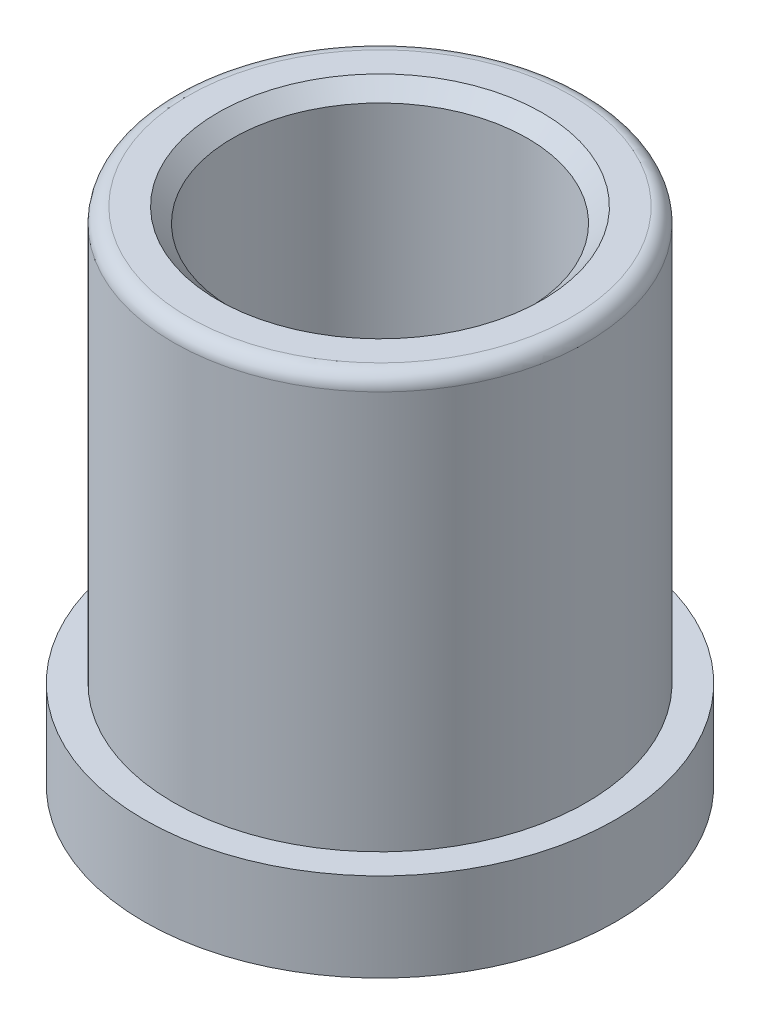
ISO-10303-21;
HEADER;
FILE_DESCRIPTION(('STEP AP214'),'2;1');
FILE_NAME('part.step','',(''),(''),'','','');
FILE_SCHEMA(('AUTOMOTIVE_DESIGN { 1 0 10303 214 1 1 1 1 }'));
ENDSEC;
DATA;
#1=APPLICATION_CONTEXT('core data for automotive mechanical design processes');
#2=APPLICATION_PROTOCOL_DEFINITION('international standard','automotive_design',2000,#1);
#3=PRODUCT_CONTEXT('',#1,'mechanical');
#4=PRODUCT('Part','Part','',(#3));
#5=PRODUCT_RELATED_PRODUCT_CATEGORY('part','',(#4));
#6=PRODUCT_DEFINITION_FORMATION('','',#4);
#7=PRODUCT_DEFINITION_CONTEXT('part definition',#1,'design');
#8=PRODUCT_DEFINITION('design','',#6,#7);
#9=PRODUCT_DEFINITION_SHAPE('','',#8);
#10=(LENGTH_UNIT() NAMED_UNIT(*) SI_UNIT(.MILLI.,.METRE.));
#11=(NAMED_UNIT(*) PLANE_ANGLE_UNIT() SI_UNIT($,.RADIAN.));
#12=(NAMED_UNIT(*) SI_UNIT($,.STERADIAN.) SOLID_ANGLE_UNIT());
#13=UNCERTAINTY_MEASURE_WITH_UNIT(LENGTH_MEASURE(1.E-05),#10,'distance_accuracy_value','');
#14=(GEOMETRIC_REPRESENTATION_CONTEXT(3) GLOBAL_UNCERTAINTY_ASSIGNED_CONTEXT((#13)) GLOBAL_UNIT_ASSIGNED_CONTEXT((#10,
#11,#12)) REPRESENTATION_CONTEXT('',''));
#15=CARTESIAN_POINT('',(0.,0.,0.));
#16=DIRECTION('',(0.,0.,1.));
#17=DIRECTION('',(1.,0.,0.));
#18=AXIS2_PLACEMENT_3D('',#15,#16,#17);
#19=CARTESIAN_POINT('',(0.,0.,0.));
#20=DIRECTION('',(0.,-1.,0.));
#21=DIRECTION('',(0.,0.,-1.));
#22=AXIS2_PLACEMENT_3D('',#19,#20,#21);
#23=CYLINDRICAL_SURFACE('',#22,7.);
#24=CARTESIAN_POINT('',(0.,13.5,0.));
#25=DIRECTION('',(0.,-1.,0.));
#26=DIRECTION('',(0.,0.,-1.));
#27=AXIS2_PLACEMENT_3D('',#24,#25,#26);
#28=CIRCLE('',#27,7.);
#29=CARTESIAN_POINT('',(0.,13.5,-7.));
#30=VERTEX_POINT('',#29);
#31=EDGE_CURVE('E21',#30,#30,#28,.T.);
#32=ORIENTED_EDGE('',*,*,#31,.T.);
#33=EDGE_LOOP('',(#32));
#34=FACE_BOUND('',#33,.T.);
#35=CARTESIAN_POINT('',(0.,0.,0.));
#36=DIRECTION('',(0.,-1.,0.));
#37=DIRECTION('',(0.,0.,-1.));
#38=AXIS2_PLACEMENT_3D('',#35,#36,#37);
#39=CIRCLE('',#38,7.);
#40=CARTESIAN_POINT('',(0.,0.,-7.));
#41=VERTEX_POINT('',#40);
#42=EDGE_CURVE('E49',#41,#41,#39,.T.);
#43=ORIENTED_EDGE('',*,*,#42,.F.);
#44=EDGE_LOOP('',(#43));
#45=FACE_BOUND('',#44,.T.);
#46=ADVANCED_FACE('F14',(#34,#45),#23,.T.);
#47=CARTESIAN_POINT('',(-7.,14.,0.));
#48=DIRECTION('',(0.,-1.,0.));
#49=DIRECTION('',(0.,0.,-1.));
#50=AXIS2_PLACEMENT_3D('',#47,#48,#49);
#51=PLANE('',#50);
#52=CARTESIAN_POINT('',(0.,14.,0.));
#53=DIRECTION('',(0.,-1.,0.));
#54=DIRECTION('',(0.,0.,-1.));
#55=AXIS2_PLACEMENT_3D('',#52,#53,#54);
#56=CIRCLE('',#55,6.5);
#57=CARTESIAN_POINT('',(0.,14.,-6.5));
#58=VERTEX_POINT('',#57);
#59=EDGE_CURVE('E9',#58,#58,#56,.F.);
#60=ORIENTED_EDGE('',*,*,#59,.T.);
#61=EDGE_LOOP('',(#60));
#62=FACE_BOUND('',#61,.T.);
#63=CARTESIAN_POINT('',(0.,14.,0.));
#64=DIRECTION('',(0.,-1.,0.));
#65=DIRECTION('',(0.,0.,-1.));
#66=AXIS2_PLACEMENT_3D('',#63,#64,#65);
#67=CIRCLE('',#66,5.5);
#68=CARTESIAN_POINT('',(0.,14.,-5.5));
#69=VERTEX_POINT('',#68);
#70=EDGE_CURVE('E37',#69,#69,#67,.T.);
#71=ORIENTED_EDGE('',*,*,#70,.T.);
#72=EDGE_LOOP('',(#71));
#73=FACE_BOUND('',#72,.T.);
#74=ADVANCED_FACE('F56',(#62,#73),#51,.F.);
#75=CARTESIAN_POINT('',(0.,0.,0.));
#76=DIRECTION('',(0.,-1.,0.));
#77=DIRECTION('',(0.,0.,-1.));
#78=AXIS2_PLACEMENT_3D('',#75,#76,#77);
#79=CYLINDRICAL_SURFACE('',#78,5.);
#80=CARTESIAN_POINT('',(0.,13.5,0.));
#81=DIRECTION('',(0.,-1.,0.));
#82=DIRECTION('',(0.,0.,-1.));
#83=AXIS2_PLACEMENT_3D('',#80,#81,#82);
#84=CIRCLE('',#83,5.);
#85=CARTESIAN_POINT('',(0.,13.5,-5.));
#86=VERTEX_POINT('',#85);
#87=EDGE_CURVE('E34',#86,#86,#84,.F.);
#88=ORIENTED_EDGE('',*,*,#87,.T.);
#89=EDGE_LOOP('',(#88));
#90=FACE_BOUND('',#89,.T.);
#91=CARTESIAN_POINT('',(0.,-3.,0.));
#92=DIRECTION('',(0.,-1.,0.));
#93=DIRECTION('',(0.,0.,-1.));
#94=AXIS2_PLACEMENT_3D('',#91,#92,#93);
#95=CIRCLE('',#94,5.);
#96=CARTESIAN_POINT('',(0.,-3.,-5.));
#97=VERTEX_POINT('',#96);
#98=EDGE_CURVE('E40',#97,#97,#95,.T.);
#99=ORIENTED_EDGE('',*,*,#98,.T.);
#100=EDGE_LOOP('',(#99));
#101=FACE_BOUND('',#100,.T.);
#102=ADVANCED_FACE('F63',(#90,#101),#79,.F.);
#103=CARTESIAN_POINT('',(0.,-3.15,0.));
#104=DIRECTION('',(0.,-1.,0.));
#105=DIRECTION('',(0.,0.,-1.));
#106=AXIS2_PLACEMENT_3D('',#103,#104,#105);
#107=CONICAL_SURFACE('',#106,5.1,0.588002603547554);
#108=CARTESIAN_POINT('',(0.,-3.36,0.));
#109=DIRECTION('',(0.,1.,0.));
#110=DIRECTION('',(0.,0.,1.));
#111=AXIS2_PLACEMENT_3D('',#108,#109,#110);
#112=CIRCLE('',#111,5.24);
#113=CARTESIAN_POINT('',(0.,-3.36,5.24));
#114=VERTEX_POINT('',#113);
#115=EDGE_CURVE('E25',#114,#114,#112,.F.);
#116=ORIENTED_EDGE('',*,*,#115,.T.);
#117=EDGE_LOOP('',(#116));
#118=FACE_BOUND('',#117,.T.);
#119=ORIENTED_EDGE('',*,*,#98,.F.);
#120=EDGE_LOOP('',(#119));
#121=FACE_BOUND('',#120,.T.);
#122=ADVANCED_FACE('F82',(#118,#121),#107,.F.);
#123=CARTESIAN_POINT('',(-5.1,-3.,0.));
#124=DIRECTION('',(0.,1.,0.));
#125=DIRECTION('',(0.,0.,1.));
#126=AXIS2_PLACEMENT_3D('',#123,#124,#125);
#127=PLANE('',#126);
#128=CARTESIAN_POINT('',(0.,-3.,0.));
#129=DIRECTION('',(0.,1.,0.));
#130=DIRECTION('',(0.,0.,1.));
#131=AXIS2_PLACEMENT_3D('',#128,#129,#130);
#132=CIRCLE('',#131,5.6);
#133=CARTESIAN_POINT('',(0.,-3.,5.6));
#134=VERTEX_POINT('',#133);
#135=EDGE_CURVE('E29',#134,#134,#132,.T.);
#136=ORIENTED_EDGE('',*,*,#135,.T.);
#137=EDGE_LOOP('',(#136));
#138=FACE_BOUND('',#137,.T.);
#139=CARTESIAN_POINT('',(0.,-3.,0.));
#140=DIRECTION('',(0.,-1.,0.));
#141=DIRECTION('',(0.,0.,-1.));
#142=AXIS2_PLACEMENT_3D('',#139,#140,#141);
#143=CIRCLE('',#142,8.);
#144=CARTESIAN_POINT('',(0.,-3.,-8.));
#145=VERTEX_POINT('',#144);
#146=EDGE_CURVE('E43',#145,#145,#143,.T.);
#147=ORIENTED_EDGE('',*,*,#146,.T.);
#148=EDGE_LOOP('',(#147));
#149=FACE_BOUND('',#148,.T.);
#150=ADVANCED_FACE('F85',(#138,#149),#127,.F.);
#151=CARTESIAN_POINT('',(0.,0.,0.));
#152=DIRECTION('',(0.,-1.,0.));
#153=DIRECTION('',(0.,0.,-1.));
#154=AXIS2_PLACEMENT_3D('',#151,#152,#153);
#155=CYLINDRICAL_SURFACE('',#154,8.);
#156=ORIENTED_EDGE('',*,*,#146,.F.);
#157=EDGE_LOOP('',(#156));
#158=FACE_BOUND('',#157,.T.);
#159=CARTESIAN_POINT('',(0.,0.,0.));
#160=DIRECTION('',(0.,-1.,0.));
#161=DIRECTION('',(0.,0.,-1.));
#162=AXIS2_PLACEMENT_3D('',#159,#160,#161);
#163=CIRCLE('',#162,8.);
#164=CARTESIAN_POINT('',(0.,0.,-8.));
#165=VERTEX_POINT('',#164);
#166=EDGE_CURVE('E46',#165,#165,#163,.T.);
#167=ORIENTED_EDGE('',*,*,#166,.T.);
#168=EDGE_LOOP('',(#167));
#169=FACE_BOUND('',#168,.T.);
#170=ADVANCED_FACE('F97',(#158,#169),#155,.T.);
#171=CARTESIAN_POINT('',(-8.,0.,0.));
#172=DIRECTION('',(0.,-1.,0.));
#173=DIRECTION('',(0.,0.,-1.));
#174=AXIS2_PLACEMENT_3D('',#171,#172,#173);
#175=PLANE('',#174);
#176=ORIENTED_EDGE('',*,*,#166,.F.);
#177=EDGE_LOOP('',(#176));
#178=FACE_BOUND('',#177,.T.);
#179=ORIENTED_EDGE('',*,*,#42,.T.);
#180=EDGE_LOOP('',(#179));
#181=FACE_BOUND('',#180,.T.);
#182=ADVANCED_FACE('F53',(#178,#181),#175,.F.);
#183=CARTESIAN_POINT('',(0.,14.,0.));
#184=DIRECTION('',(0.,1.,0.));
#185=DIRECTION('',(0.,0.,1.));
#186=AXIS2_PLACEMENT_3D('',#183,#184,#185);
#187=CONICAL_SURFACE('',#186,5.5,0.785398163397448);
#188=ORIENTED_EDGE('',*,*,#87,.F.);
#189=EDGE_LOOP('',(#188));
#190=FACE_BOUND('',#189,.T.);
#191=ORIENTED_EDGE('',*,*,#70,.F.);
#192=EDGE_LOOP('',(#191));
#193=FACE_BOUND('',#192,.T.);
#194=ADVANCED_FACE('F67',(#190,#193),#187,.F.);
#195=CARTESIAN_POINT('',(0.,-3.5,0.));
#196=DIRECTION('',(0.,1.,0.));
#197=DIRECTION('',(0.,0.,1.));
#198=AXIS2_PLACEMENT_3D('',#195,#196,#197);
#199=CONICAL_SURFACE('',#198,5.1,0.785398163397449);
#200=ORIENTED_EDGE('',*,*,#135,.F.);
#201=EDGE_LOOP('',(#200));
#202=FACE_BOUND('',#201,.T.);
#203=ORIENTED_EDGE('',*,*,#115,.F.);
#204=EDGE_LOOP('',(#203));
#205=FACE_BOUND('',#204,.T.);
#206=ADVANCED_FACE('F69',(#202,#205),#199,.T.);
#207=CARTESIAN_POINT('',(0.,13.5,0.));
#208=DIRECTION('',(0.,-1.,0.));
#209=DIRECTION('',(0.,0.,-1.));
#210=AXIS2_PLACEMENT_3D('',#207,#208,#209);
#211=TOROIDAL_SURFACE('',#210,6.5,0.5);
#212=ORIENTED_EDGE('',*,*,#59,.F.);
#213=EDGE_LOOP('',(#212));
#214=FACE_BOUND('',#213,.T.);
#215=ORIENTED_EDGE('',*,*,#31,.F.);
#216=EDGE_LOOP('',(#215));
#217=FACE_BOUND('',#216,.T.);
#218=ADVANCED_FACE('F16',(#214,#217),#211,.T.);
#219=CLOSED_SHELL('',(#46,#74,#102,#122,#150,#170,#182,#194,#206,#218));
#220=MANIFOLD_SOLID_BREP('B1',#219);
#221=ADVANCED_BREP_SHAPE_REPRESENTATION('',(#18,#220),#14);
#222=SHAPE_DEFINITION_REPRESENTATION(#9,#221);
ENDSEC;
END-ISO-10303-21;
